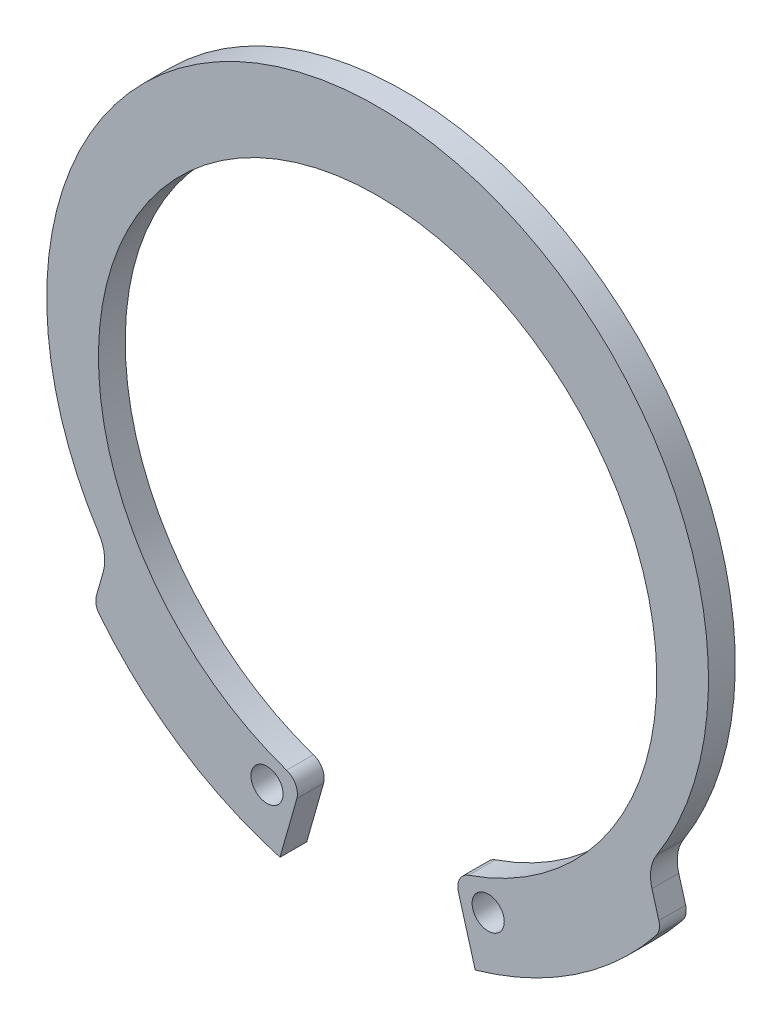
from build123d import *

# Parameters (mm, degrees)
BODYSKE_R  = 0.381
BODY_DEPTH = 0.635


with BuildPart() as part:
    # BodySke → Body (new body)
    with BuildSketch(Plane.XY):
        with BuildLine():
            Line((-1.91450535, -6.719919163), (-2.314042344, -8.122295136))
            ThreePointArc((-2.314042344, -8.122295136), (-4.67753589, -7.031865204), (-6.59672094, -5.273494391))
            ThreePointArc((-6.59672094, -5.273494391), (-6.672649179, -5.110694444), (-6.665543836, -4.931199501))
            Line((-6.665543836, -4.931199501), (-6.501980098, -4.357090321))
            ThreePointArc((-6.501980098, -4.357090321), (-6.476670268, -3.974948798), (-6.610396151, -3.616075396))
            ThreePointArc((-6.610396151, -3.616075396), (0, 8.4455), (6.610396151, -3.616075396))
            ThreePointArc((6.610396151, -3.616075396), (6.476670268, -3.974948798), (6.501980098, -4.357090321))
            Line((6.501980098, -4.357090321), (6.665543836, -4.931199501))
            ThreePointArc((6.665543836, -4.931199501), (6.672649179, -5.110694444), (6.59672094, -5.273494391))
            ThreePointArc((6.59672094, -5.273494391), (4.67753589, -7.031865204), (2.314042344, -8.122295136))
            Line((2.314042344, -8.122295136), (1.91450535, -6.719919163))
            ThreePointArc((1.91450535, -6.719919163), (1.943087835, -6.439380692), (2.156736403, -6.255334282))
            ThreePointArc((2.156736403, -6.255334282), (0, 6.6167), (-2.156736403, -6.255334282))
            ThreePointArc((-2.156736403, -6.255334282), (-1.943087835, -6.439380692), (-1.91450535, -6.719919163))
        make_face()
        with Locations((2.620803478, -6.78878292)):
            Circle(BODYSKE_R, mode=Mode.SUBTRACT)
        with Locations((-2.620803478, -6.78878292)):
            Circle(BODYSKE_R, mode=Mode.SUBTRACT)
    extrude(amount=-BODY_DEPTH)


solid = part.part
